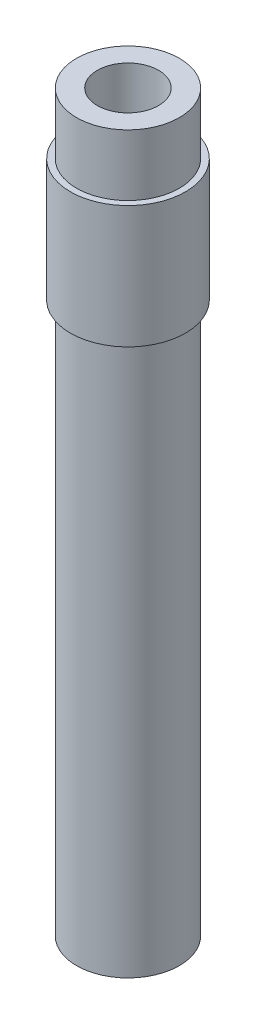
from build123d import *

# Parameters (mm, degrees)
SKETCH1_R           = 10.668
SKETCH1_R_2         = 6.35
BOSS_EXTRUDE1_DEPTH = 152.4
SKETCH2_W           = 1.27
SKETCH2_H           = 25.4


with BuildPart() as part:
    # Sketch1 → Boss-Extrude1 (new body)
    with BuildSketch(Plane(origin=(0, 0, 0), x_dir=(1, 0, 0), z_dir=(0, 1, 0))):
        with Locations(Location((0, 0, 0), (0, 0, 90))):
            Circle(SKETCH1_R)
        with Locations(Location((0, 0, 0), (0, 0, 90))):
            Circle(SKETCH1_R_2, mode=Mode.SUBTRACT)
    extrude(amount=BOSS_EXTRUDE1_DEPTH)

    # Sketch2 → Revolve1 (revolve)
    with BuildSketch(Plane.XY, mode=Mode.PRIVATE) as revolve1_sk:
        with Locations((11.303, 127)):
            Rectangle(SKETCH2_W, SKETCH2_H)
    revolve(revolve1_sk.sketch.rotate(Axis((0, 152.4, 0), (0, -1, 0)), 270), axis=Axis((0, 152.4, 0), (0, -1, 0)))


solid = part.part
